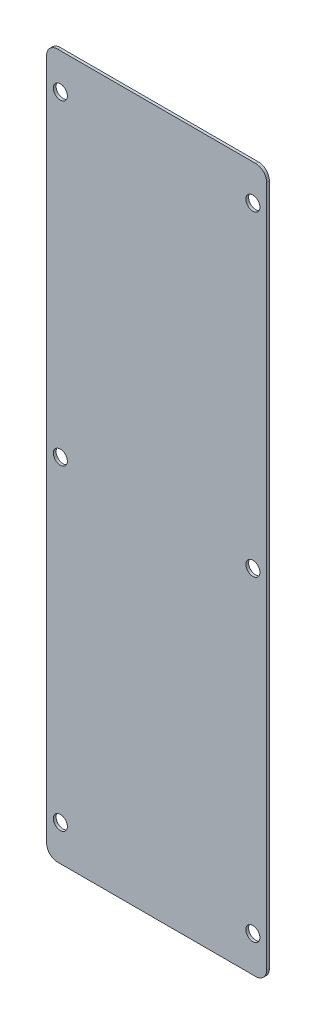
ISO-10303-21;
HEADER;
FILE_DESCRIPTION(('STEP AP214'),'2;1');
FILE_NAME('part.step','',(''),(''),'','','');
FILE_SCHEMA(('AUTOMOTIVE_DESIGN { 1 0 10303 214 1 1 1 1 }'));
ENDSEC;
DATA;
#1=APPLICATION_CONTEXT('core data for automotive mechanical design processes');
#2=APPLICATION_PROTOCOL_DEFINITION('international standard','automotive_design',2000,#1);
#3=PRODUCT_CONTEXT('',#1,'mechanical');
#4=PRODUCT('Part','Part','',(#3));
#5=PRODUCT_RELATED_PRODUCT_CATEGORY('part','',(#4));
#6=PRODUCT_DEFINITION_FORMATION('','',#4);
#7=PRODUCT_DEFINITION_CONTEXT('part definition',#1,'design');
#8=PRODUCT_DEFINITION('design','',#6,#7);
#9=PRODUCT_DEFINITION_SHAPE('','',#8);
#10=(LENGTH_UNIT() NAMED_UNIT(*) SI_UNIT(.MILLI.,.METRE.));
#11=(NAMED_UNIT(*) PLANE_ANGLE_UNIT() SI_UNIT($,.RADIAN.));
#12=(NAMED_UNIT(*) SI_UNIT($,.STERADIAN.) SOLID_ANGLE_UNIT());
#13=UNCERTAINTY_MEASURE_WITH_UNIT(LENGTH_MEASURE(1.E-05),#10,'distance_accuracy_value','');
#14=(GEOMETRIC_REPRESENTATION_CONTEXT(3) GLOBAL_UNCERTAINTY_ASSIGNED_CONTEXT((#13)) GLOBAL_UNIT_ASSIGNED_CONTEXT((#10,
#11,#12)) REPRESENTATION_CONTEXT('',''));
#15=CARTESIAN_POINT('',(0.,0.,0.));
#16=DIRECTION('',(0.,0.,1.));
#17=DIRECTION('',(1.,0.,0.));
#18=AXIS2_PLACEMENT_3D('',#15,#16,#17);
#19=CARTESIAN_POINT('',(40.,-128.,1.));
#20=DIRECTION('',(-1.,0.,0.));
#21=DIRECTION('',(0.,0.,1.));
#22=AXIS2_PLACEMENT_3D('',#19,#20,#21);
#23=PLANE('',#22);
#24=DIRECTION('',(0.,1.,0.));
#25=VECTOR('',#24,1.);
#26=CARTESIAN_POINT('',(40.,-128.,1.));
#27=LINE('',#26,#25);
#28=CARTESIAN_POINT('',(40.,-124.,1.));
#29=VERTEX_POINT('',#28);
#30=CARTESIAN_POINT('',(40.,124.,1.));
#31=VERTEX_POINT('',#30);
#32=EDGE_CURVE('E127',#29,#31,#27,.T.);
#33=ORIENTED_EDGE('',*,*,#32,.F.);
#34=DIRECTION('',(0.,0.,-1.));
#35=VECTOR('',#34,1.);
#36=CARTESIAN_POINT('',(40.,-124.,1.));
#37=LINE('',#36,#35);
#38=CARTESIAN_POINT('',(40.,-124.,0.));
#39=VERTEX_POINT('',#38);
#40=EDGE_CURVE('E11',#29,#39,#37,.T.);
#41=ORIENTED_EDGE('',*,*,#40,.T.);
#42=DIRECTION('',(0.,1.,0.));
#43=VECTOR('',#42,1.);
#44=CARTESIAN_POINT('',(40.,-128.,0.));
#45=LINE('',#44,#43);
#46=CARTESIAN_POINT('',(40.,124.,0.));
#47=VERTEX_POINT('',#46);
#48=EDGE_CURVE('E129',#39,#47,#45,.T.);
#49=ORIENTED_EDGE('',*,*,#48,.T.);
#50=DIRECTION('',(0.,0.,-1.));
#51=VECTOR('',#50,1.);
#52=CARTESIAN_POINT('',(40.,124.,1.));
#53=LINE('',#52,#51);
#54=EDGE_CURVE('E40',#47,#31,#53,.F.);
#55=ORIENTED_EDGE('',*,*,#54,.T.);
#56=EDGE_LOOP('',(#33,#41,#49,#55));
#57=FACE_BOUND('',#56,.T.);
#58=ADVANCED_FACE('F32',(#57),#23,.F.);
#59=CARTESIAN_POINT('',(-40.,128.,1.));
#60=DIRECTION('',(0.,-1.,0.));
#61=DIRECTION('',(0.,0.,-1.));
#62=AXIS2_PLACEMENT_3D('',#59,#60,#61);
#63=PLANE('',#62);
#64=DIRECTION('',(-1.,0.,0.));
#65=VECTOR('',#64,1.);
#66=CARTESIAN_POINT('',(-40.,128.,0.));
#67=LINE('',#66,#65);
#68=CARTESIAN_POINT('',(36.,128.,0.));
#69=VERTEX_POINT('',#68);
#70=CARTESIAN_POINT('',(-36.,128.,0.));
#71=VERTEX_POINT('',#70);
#72=EDGE_CURVE('E125',#69,#71,#67,.T.);
#73=ORIENTED_EDGE('',*,*,#72,.T.);
#74=DIRECTION('',(0.,0.,-1.));
#75=VECTOR('',#74,1.);
#76=CARTESIAN_POINT('',(-36.,128.,1.));
#77=LINE('',#76,#75);
#78=CARTESIAN_POINT('',(-36.,128.,1.));
#79=VERTEX_POINT('',#78);
#80=EDGE_CURVE('E104',#71,#79,#77,.F.);
#81=ORIENTED_EDGE('',*,*,#80,.T.);
#82=DIRECTION('',(-1.,0.,0.));
#83=VECTOR('',#82,1.);
#84=CARTESIAN_POINT('',(-40.,128.,1.));
#85=LINE('',#84,#83);
#86=CARTESIAN_POINT('',(36.,128.,1.));
#87=VERTEX_POINT('',#86);
#88=EDGE_CURVE('E165',#87,#79,#85,.T.);
#89=ORIENTED_EDGE('',*,*,#88,.F.);
#90=DIRECTION('',(0.,0.,-1.));
#91=VECTOR('',#90,1.);
#92=CARTESIAN_POINT('',(36.,128.,1.));
#93=LINE('',#92,#91);
#94=EDGE_CURVE('E109',#87,#69,#93,.T.);
#95=ORIENTED_EDGE('',*,*,#94,.T.);
#96=EDGE_LOOP('',(#73,#81,#89,#95));
#97=FACE_BOUND('',#96,.T.);
#98=ADVANCED_FACE('F169',(#97),#63,.F.);
#99=CARTESIAN_POINT('',(-40.,-128.,1.));
#100=DIRECTION('',(1.,0.,0.));
#101=DIRECTION('',(0.,0.,-1.));
#102=AXIS2_PLACEMENT_3D('',#99,#100,#101);
#103=PLANE('',#102);
#104=DIRECTION('',(0.,-1.,0.));
#105=VECTOR('',#104,1.);
#106=CARTESIAN_POINT('',(-40.,-128.,1.));
#107=LINE('',#106,#105);
#108=CARTESIAN_POINT('',(-40.,124.,1.));
#109=VERTEX_POINT('',#108);
#110=CARTESIAN_POINT('',(-40.,-124.,1.));
#111=VERTEX_POINT('',#110);
#112=EDGE_CURVE('E118',#109,#111,#107,.T.);
#113=ORIENTED_EDGE('',*,*,#112,.F.);
#114=DIRECTION('',(0.,0.,-1.));
#115=VECTOR('',#114,1.);
#116=CARTESIAN_POINT('',(-40.,124.,1.));
#117=LINE('',#116,#115);
#118=CARTESIAN_POINT('',(-40.,124.,0.));
#119=VERTEX_POINT('',#118);
#120=EDGE_CURVE('E103',#109,#119,#117,.T.);
#121=ORIENTED_EDGE('',*,*,#120,.T.);
#122=DIRECTION('',(0.,-1.,0.));
#123=VECTOR('',#122,1.);
#124=CARTESIAN_POINT('',(-40.,-128.,0.));
#125=LINE('',#124,#123);
#126=CARTESIAN_POINT('',(-40.,-124.,0.));
#127=VERTEX_POINT('',#126);
#128=EDGE_CURVE('E116',#119,#127,#125,.T.);
#129=ORIENTED_EDGE('',*,*,#128,.T.);
#130=DIRECTION('',(0.,0.,-1.));
#131=VECTOR('',#130,1.);
#132=CARTESIAN_POINT('',(-40.,-124.,1.));
#133=LINE('',#132,#131);
#134=EDGE_CURVE('E120',#127,#111,#133,.F.);
#135=ORIENTED_EDGE('',*,*,#134,.T.);
#136=EDGE_LOOP('',(#113,#121,#129,#135));
#137=FACE_BOUND('',#136,.T.);
#138=ADVANCED_FACE('F115',(#137),#103,.F.);
#139=CARTESIAN_POINT('',(-40.,-128.,1.));
#140=DIRECTION('',(0.,1.,0.));
#141=DIRECTION('',(0.,0.,1.));
#142=AXIS2_PLACEMENT_3D('',#139,#140,#141);
#143=PLANE('',#142);
#144=DIRECTION('',(1.,0.,0.));
#145=VECTOR('',#144,1.);
#146=CARTESIAN_POINT('',(-40.,-128.,1.));
#147=LINE('',#146,#145);
#148=CARTESIAN_POINT('',(-36.,-128.,1.));
#149=VERTEX_POINT('',#148);
#150=CARTESIAN_POINT('',(36.,-128.,1.));
#151=VERTEX_POINT('',#150);
#152=EDGE_CURVE('E133',#149,#151,#147,.T.);
#153=ORIENTED_EDGE('',*,*,#152,.F.);
#154=DIRECTION('',(0.,0.,-1.));
#155=VECTOR('',#154,1.);
#156=CARTESIAN_POINT('',(-36.,-128.,1.));
#157=LINE('',#156,#155);
#158=CARTESIAN_POINT('',(-36.,-128.,0.));
#159=VERTEX_POINT('',#158);
#160=EDGE_CURVE('E150',#149,#159,#157,.T.);
#161=ORIENTED_EDGE('',*,*,#160,.T.);
#162=DIRECTION('',(1.,0.,0.));
#163=VECTOR('',#162,1.);
#164=CARTESIAN_POINT('',(-40.,-128.,0.));
#165=LINE('',#164,#163);
#166=CARTESIAN_POINT('',(36.,-128.,0.));
#167=VERTEX_POINT('',#166);
#168=EDGE_CURVE('E124',#159,#167,#165,.T.);
#169=ORIENTED_EDGE('',*,*,#168,.T.);
#170=DIRECTION('',(0.,0.,-1.));
#171=VECTOR('',#170,1.);
#172=CARTESIAN_POINT('',(36.,-128.,1.));
#173=LINE('',#172,#171);
#174=EDGE_CURVE('E47',#167,#151,#173,.F.);
#175=ORIENTED_EDGE('',*,*,#174,.T.);
#176=EDGE_LOOP('',(#153,#161,#169,#175));
#177=FACE_BOUND('',#176,.T.);
#178=ADVANCED_FACE('F223',(#177),#143,.F.);
#179=CARTESIAN_POINT('',(0.,0.,1.));
#180=DIRECTION('',(0.,0.,-1.));
#181=DIRECTION('',(-1.,0.,0.));
#182=AXIS2_PLACEMENT_3D('',#179,#180,#181);
#183=PLANE('',#182);
#184=CARTESIAN_POINT('',(-35.0000000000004,-115.,1.));
#185=DIRECTION('',(0.,0.,1.));
#186=DIRECTION('',(1.,0.,0.));
#187=AXIS2_PLACEMENT_3D('',#184,#185,#186);
#188=CIRCLE('',#187,2.55);
#189=CARTESIAN_POINT('',(-32.4500000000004,-115.,1.));
#190=VERTEX_POINT('',#189);
#191=EDGE_CURVE('E200',#190,#190,#188,.T.);
#192=ORIENTED_EDGE('',*,*,#191,.F.);
#193=EDGE_LOOP('',(#192));
#194=FACE_BOUND('',#193,.T.);
#195=CARTESIAN_POINT('',(-35.,1.36830597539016E-13,1.));
#196=DIRECTION('',(0.,0.,1.));
#197=DIRECTION('',(1.,0.,0.));
#198=AXIS2_PLACEMENT_3D('',#195,#196,#197);
#199=CIRCLE('',#198,2.55);
#200=CARTESIAN_POINT('',(-32.45,1.36830597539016E-13,1.));
#201=VERTEX_POINT('',#200);
#202=EDGE_CURVE('E194',#201,#201,#199,.T.);
#203=ORIENTED_EDGE('',*,*,#202,.F.);
#204=EDGE_LOOP('',(#203));
#205=FACE_BOUND('',#204,.T.);
#206=CARTESIAN_POINT('',(35.,-1.16084391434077E-13,1.));
#207=DIRECTION('',(0.,0.,1.));
#208=DIRECTION('',(1.,0.,0.));
#209=AXIS2_PLACEMENT_3D('',#206,#207,#208);
#210=CIRCLE('',#209,2.55);
#211=CARTESIAN_POINT('',(37.55,-1.16084391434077E-13,1.));
#212=VERTEX_POINT('',#211);
#213=EDGE_CURVE('E188',#212,#212,#210,.T.);
#214=ORIENTED_EDGE('',*,*,#213,.F.);
#215=EDGE_LOOP('',(#214));
#216=FACE_BOUND('',#215,.T.);
#217=CARTESIAN_POINT('',(35.0000000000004,115.,1.));
#218=DIRECTION('',(0.,0.,1.));
#219=DIRECTION('',(1.,0.,0.));
#220=AXIS2_PLACEMENT_3D('',#217,#218,#219);
#221=CIRCLE('',#220,2.55);
#222=CARTESIAN_POINT('',(37.5500000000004,115.,1.));
#223=VERTEX_POINT('',#222);
#224=EDGE_CURVE('E181',#223,#223,#221,.T.);
#225=ORIENTED_EDGE('',*,*,#224,.F.);
#226=EDGE_LOOP('',(#225));
#227=FACE_BOUND('',#226,.T.);
#228=CARTESIAN_POINT('',(-34.9999999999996,115.,1.));
#229=DIRECTION('',(0.,0.,1.));
#230=DIRECTION('',(1.,0.,0.));
#231=AXIS2_PLACEMENT_3D('',#228,#229,#230);
#232=CIRCLE('',#231,2.55);
#233=CARTESIAN_POINT('',(-32.4499999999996,115.,1.));
#234=VERTEX_POINT('',#233);
#235=EDGE_CURVE('E205',#234,#234,#232,.T.);
#236=ORIENTED_EDGE('',*,*,#235,.F.);
#237=EDGE_LOOP('',(#236));
#238=FACE_BOUND('',#237,.T.);
#239=CARTESIAN_POINT('',(34.9999999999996,-115.,1.));
#240=DIRECTION('',(0.,0.,1.));
#241=DIRECTION('',(1.,0.,0.));
#242=AXIS2_PLACEMENT_3D('',#239,#240,#241);
#243=CIRCLE('',#242,2.55);
#244=CARTESIAN_POINT('',(37.5499999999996,-115.,1.));
#245=VERTEX_POINT('',#244);
#246=EDGE_CURVE('E172',#245,#245,#243,.T.);
#247=ORIENTED_EDGE('',*,*,#246,.F.);
#248=EDGE_LOOP('',(#247));
#249=FACE_BOUND('',#248,.T.);
#250=ORIENTED_EDGE('',*,*,#88,.T.);
#251=CARTESIAN_POINT('',(-36.,124.,1.));
#252=DIRECTION('',(0.,0.,-1.));
#253=DIRECTION('',(-1.,0.,0.));
#254=AXIS2_PLACEMENT_3D('',#251,#252,#253);
#255=CIRCLE('',#254,4.);
#256=EDGE_CURVE('E147',#79,#109,#255,.F.);
#257=ORIENTED_EDGE('',*,*,#256,.T.);
#258=ORIENTED_EDGE('',*,*,#112,.T.);
#259=CARTESIAN_POINT('',(-36.,-124.,1.));
#260=DIRECTION('',(0.,0.,-1.));
#261=DIRECTION('',(-1.,0.,0.));
#262=AXIS2_PLACEMENT_3D('',#259,#260,#261);
#263=CIRCLE('',#262,4.);
#264=EDGE_CURVE('E54',#111,#149,#263,.F.);
#265=ORIENTED_EDGE('',*,*,#264,.T.);
#266=ORIENTED_EDGE('',*,*,#152,.T.);
#267=CARTESIAN_POINT('',(36.,-124.,1.));
#268=DIRECTION('',(0.,0.,-1.));
#269=DIRECTION('',(-1.,0.,0.));
#270=AXIS2_PLACEMENT_3D('',#267,#268,#269);
#271=CIRCLE('',#270,4.);
#272=EDGE_CURVE('E144',#151,#29,#271,.F.);
#273=ORIENTED_EDGE('',*,*,#272,.T.);
#274=ORIENTED_EDGE('',*,*,#32,.T.);
#275=CARTESIAN_POINT('',(36.,124.,1.));
#276=DIRECTION('',(0.,0.,-1.));
#277=DIRECTION('',(-1.,0.,0.));
#278=AXIS2_PLACEMENT_3D('',#275,#276,#277);
#279=CIRCLE('',#278,4.);
#280=EDGE_CURVE('E142',#31,#87,#279,.F.);
#281=ORIENTED_EDGE('',*,*,#280,.T.);
#282=EDGE_LOOP('',(#250,#257,#258,#265,#266,#273,#274,#281));
#283=FACE_BOUND('',#282,.T.);
#284=ADVANCED_FACE('F162',(#194,#205,#216,#227,#238,#249,#283),#183,.F.);
#285=CARTESIAN_POINT('',(0.,0.,0.));
#286=DIRECTION('',(0.,0.,-1.));
#287=DIRECTION('',(-1.,0.,0.));
#288=AXIS2_PLACEMENT_3D('',#285,#286,#287);
#289=PLANE('',#288);
#290=CARTESIAN_POINT('',(-35.0000000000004,-115.,0.));
#291=DIRECTION('',(0.,0.,1.));
#292=DIRECTION('',(1.,0.,0.));
#293=AXIS2_PLACEMENT_3D('',#290,#291,#292);
#294=CIRCLE('',#293,2.55);
#295=CARTESIAN_POINT('',(-32.4500000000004,-115.,0.));
#296=VERTEX_POINT('',#295);
#297=EDGE_CURVE('E179',#296,#296,#294,.T.);
#298=ORIENTED_EDGE('',*,*,#297,.T.);
#299=EDGE_LOOP('',(#298));
#300=FACE_BOUND('',#299,.T.);
#301=CARTESIAN_POINT('',(-35.,1.36830597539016E-13,0.));
#302=DIRECTION('',(0.,0.,1.));
#303=DIRECTION('',(1.,0.,0.));
#304=AXIS2_PLACEMENT_3D('',#301,#302,#303);
#305=CIRCLE('',#304,2.55);
#306=CARTESIAN_POINT('',(-32.45,1.36830597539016E-13,0.));
#307=VERTEX_POINT('',#306);
#308=EDGE_CURVE('E197',#307,#307,#305,.T.);
#309=ORIENTED_EDGE('',*,*,#308,.T.);
#310=EDGE_LOOP('',(#309));
#311=FACE_BOUND('',#310,.T.);
#312=CARTESIAN_POINT('',(35.,-1.16084391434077E-13,0.));
#313=DIRECTION('',(0.,0.,1.));
#314=DIRECTION('',(1.,0.,0.));
#315=AXIS2_PLACEMENT_3D('',#312,#313,#314);
#316=CIRCLE('',#315,2.55);
#317=CARTESIAN_POINT('',(37.55,-1.16084391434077E-13,0.));
#318=VERTEX_POINT('',#317);
#319=EDGE_CURVE('E191',#318,#318,#316,.T.);
#320=ORIENTED_EDGE('',*,*,#319,.T.);
#321=EDGE_LOOP('',(#320));
#322=FACE_BOUND('',#321,.T.);
#323=CARTESIAN_POINT('',(35.0000000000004,115.,0.));
#324=DIRECTION('',(0.,0.,1.));
#325=DIRECTION('',(1.,0.,0.));
#326=AXIS2_PLACEMENT_3D('',#323,#324,#325);
#327=CIRCLE('',#326,2.55);
#328=CARTESIAN_POINT('',(37.5500000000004,115.,0.));
#329=VERTEX_POINT('',#328);
#330=EDGE_CURVE('E184',#329,#329,#327,.T.);
#331=ORIENTED_EDGE('',*,*,#330,.T.);
#332=EDGE_LOOP('',(#331));
#333=FACE_BOUND('',#332,.T.);
#334=CARTESIAN_POINT('',(-34.9999999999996,115.,0.));
#335=DIRECTION('',(0.,0.,1.));
#336=DIRECTION('',(1.,0.,0.));
#337=AXIS2_PLACEMENT_3D('',#334,#335,#336);
#338=CIRCLE('',#337,2.55);
#339=CARTESIAN_POINT('',(-32.4499999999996,115.,0.));
#340=VERTEX_POINT('',#339);
#341=EDGE_CURVE('E185',#340,#340,#338,.T.);
#342=ORIENTED_EDGE('',*,*,#341,.T.);
#343=EDGE_LOOP('',(#342));
#344=FACE_BOUND('',#343,.T.);
#345=CARTESIAN_POINT('',(34.9999999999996,-115.,0.));
#346=DIRECTION('',(0.,0.,1.));
#347=DIRECTION('',(1.,0.,0.));
#348=AXIS2_PLACEMENT_3D('',#345,#346,#347);
#349=CIRCLE('',#348,2.55);
#350=CARTESIAN_POINT('',(37.5499999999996,-115.,0.));
#351=VERTEX_POINT('',#350);
#352=EDGE_CURVE('E170',#351,#351,#349,.T.);
#353=ORIENTED_EDGE('',*,*,#352,.T.);
#354=EDGE_LOOP('',(#353));
#355=FACE_BOUND('',#354,.T.);
#356=ORIENTED_EDGE('',*,*,#128,.F.);
#357=CARTESIAN_POINT('',(-36.,124.,0.));
#358=DIRECTION('',(0.,0.,-1.));
#359=DIRECTION('',(-1.,0.,0.));
#360=AXIS2_PLACEMENT_3D('',#357,#358,#359);
#361=CIRCLE('',#360,4.);
#362=EDGE_CURVE('E99',#119,#71,#361,.T.);
#363=ORIENTED_EDGE('',*,*,#362,.T.);
#364=ORIENTED_EDGE('',*,*,#72,.F.);
#365=CARTESIAN_POINT('',(36.,124.,0.));
#366=DIRECTION('',(0.,0.,-1.));
#367=DIRECTION('',(-1.,0.,0.));
#368=AXIS2_PLACEMENT_3D('',#365,#366,#367);
#369=CIRCLE('',#368,4.);
#370=EDGE_CURVE('E119',#69,#47,#369,.T.);
#371=ORIENTED_EDGE('',*,*,#370,.T.);
#372=ORIENTED_EDGE('',*,*,#48,.F.);
#373=CARTESIAN_POINT('',(36.,-124.,0.));
#374=DIRECTION('',(0.,0.,-1.));
#375=DIRECTION('',(-1.,0.,0.));
#376=AXIS2_PLACEMENT_3D('',#373,#374,#375);
#377=CIRCLE('',#376,4.);
#378=EDGE_CURVE('E136',#39,#167,#377,.T.);
#379=ORIENTED_EDGE('',*,*,#378,.T.);
#380=ORIENTED_EDGE('',*,*,#168,.F.);
#381=CARTESIAN_POINT('',(-36.,-124.,0.));
#382=DIRECTION('',(0.,0.,-1.));
#383=DIRECTION('',(-1.,0.,0.));
#384=AXIS2_PLACEMENT_3D('',#381,#382,#383);
#385=CIRCLE('',#384,4.);
#386=EDGE_CURVE('E110',#159,#127,#385,.T.);
#387=ORIENTED_EDGE('',*,*,#386,.T.);
#388=EDGE_LOOP('',(#356,#363,#364,#371,#372,#379,#380,#387));
#389=FACE_BOUND('',#388,.T.);
#390=ADVANCED_FACE('F122',(#300,#311,#322,#333,#344,#355,#389),#289,.T.);
#391=CARTESIAN_POINT('',(-36.,124.,1.));
#392=DIRECTION('',(0.,0.,-1.));
#393=DIRECTION('',(-1.,0.,0.));
#394=AXIS2_PLACEMENT_3D('',#391,#392,#393);
#395=CYLINDRICAL_SURFACE('',#394,4.);
#396=ORIENTED_EDGE('',*,*,#256,.F.);
#397=ORIENTED_EDGE('',*,*,#80,.F.);
#398=ORIENTED_EDGE('',*,*,#362,.F.);
#399=ORIENTED_EDGE('',*,*,#120,.F.);
#400=EDGE_LOOP('',(#396,#397,#398,#399));
#401=FACE_BOUND('',#400,.T.);
#402=ADVANCED_FACE('F102',(#401),#395,.T.);
#403=CARTESIAN_POINT('',(-36.,-124.,1.));
#404=DIRECTION('',(0.,0.,-1.));
#405=DIRECTION('',(-1.,0.,0.));
#406=AXIS2_PLACEMENT_3D('',#403,#404,#405);
#407=CYLINDRICAL_SURFACE('',#406,4.);
#408=ORIENTED_EDGE('',*,*,#264,.F.);
#409=ORIENTED_EDGE('',*,*,#134,.F.);
#410=ORIENTED_EDGE('',*,*,#386,.F.);
#411=ORIENTED_EDGE('',*,*,#160,.F.);
#412=EDGE_LOOP('',(#408,#409,#410,#411));
#413=FACE_BOUND('',#412,.T.);
#414=ADVANCED_FACE('F247',(#413),#407,.T.);
#415=CARTESIAN_POINT('',(36.,-124.,1.));
#416=DIRECTION('',(0.,0.,-1.));
#417=DIRECTION('',(-1.,0.,0.));
#418=AXIS2_PLACEMENT_3D('',#415,#416,#417);
#419=CYLINDRICAL_SURFACE('',#418,4.);
#420=ORIENTED_EDGE('',*,*,#272,.F.);
#421=ORIENTED_EDGE('',*,*,#174,.F.);
#422=ORIENTED_EDGE('',*,*,#378,.F.);
#423=ORIENTED_EDGE('',*,*,#40,.F.);
#424=EDGE_LOOP('',(#420,#421,#422,#423));
#425=FACE_BOUND('',#424,.T.);
#426=ADVANCED_FACE('F234',(#425),#419,.T.);
#427=CARTESIAN_POINT('',(36.,124.,1.));
#428=DIRECTION('',(0.,0.,-1.));
#429=DIRECTION('',(-1.,0.,0.));
#430=AXIS2_PLACEMENT_3D('',#427,#428,#429);
#431=CYLINDRICAL_SURFACE('',#430,4.);
#432=ORIENTED_EDGE('',*,*,#280,.F.);
#433=ORIENTED_EDGE('',*,*,#54,.F.);
#434=ORIENTED_EDGE('',*,*,#370,.F.);
#435=ORIENTED_EDGE('',*,*,#94,.F.);
#436=EDGE_LOOP('',(#432,#433,#434,#435));
#437=FACE_BOUND('',#436,.T.);
#438=ADVANCED_FACE('F34',(#437),#431,.T.);
#439=CARTESIAN_POINT('',(34.9999999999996,-115.,0.));
#440=DIRECTION('',(0.,0.,1.));
#441=DIRECTION('',(1.,0.,0.));
#442=AXIS2_PLACEMENT_3D('',#439,#440,#441);
#443=CYLINDRICAL_SURFACE('',#442,2.55);
#444=ORIENTED_EDGE('',*,*,#352,.F.);
#445=EDGE_LOOP('',(#444));
#446=FACE_BOUND('',#445,.T.);
#447=ORIENTED_EDGE('',*,*,#246,.T.);
#448=EDGE_LOOP('',(#447));
#449=FACE_BOUND('',#448,.T.);
#450=ADVANCED_FACE('F217',(#446,#449),#443,.F.);
#451=CARTESIAN_POINT('',(-34.9999999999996,115.,0.));
#452=DIRECTION('',(0.,0.,1.));
#453=DIRECTION('',(1.,0.,0.));
#454=AXIS2_PLACEMENT_3D('',#451,#452,#453);
#455=CYLINDRICAL_SURFACE('',#454,2.55);
#456=ORIENTED_EDGE('',*,*,#341,.F.);
#457=EDGE_LOOP('',(#456));
#458=FACE_BOUND('',#457,.T.);
#459=ORIENTED_EDGE('',*,*,#235,.T.);
#460=EDGE_LOOP('',(#459));
#461=FACE_BOUND('',#460,.T.);
#462=ADVANCED_FACE('F213',(#458,#461),#455,.F.);
#463=CARTESIAN_POINT('',(35.0000000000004,115.,0.));
#464=DIRECTION('',(0.,0.,1.));
#465=DIRECTION('',(1.,0.,0.));
#466=AXIS2_PLACEMENT_3D('',#463,#464,#465);
#467=CYLINDRICAL_SURFACE('',#466,2.55);
#468=ORIENTED_EDGE('',*,*,#330,.F.);
#469=EDGE_LOOP('',(#468));
#470=FACE_BOUND('',#469,.T.);
#471=ORIENTED_EDGE('',*,*,#224,.T.);
#472=EDGE_LOOP('',(#471));
#473=FACE_BOUND('',#472,.T.);
#474=ADVANCED_FACE('F216',(#470,#473),#467,.F.);
#475=CARTESIAN_POINT('',(35.,-1.16084391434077E-13,0.));
#476=DIRECTION('',(0.,0.,1.));
#477=DIRECTION('',(1.,0.,0.));
#478=AXIS2_PLACEMENT_3D('',#475,#476,#477);
#479=CYLINDRICAL_SURFACE('',#478,2.55);
#480=ORIENTED_EDGE('',*,*,#319,.F.);
#481=EDGE_LOOP('',(#480));
#482=FACE_BOUND('',#481,.T.);
#483=ORIENTED_EDGE('',*,*,#213,.T.);
#484=EDGE_LOOP('',(#483));
#485=FACE_BOUND('',#484,.T.);
#486=ADVANCED_FACE('F297',(#482,#485),#479,.F.);
#487=CARTESIAN_POINT('',(-35.,1.36830597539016E-13,0.));
#488=DIRECTION('',(0.,0.,1.));
#489=DIRECTION('',(1.,0.,0.));
#490=AXIS2_PLACEMENT_3D('',#487,#488,#489);
#491=CYLINDRICAL_SURFACE('',#490,2.55);
#492=ORIENTED_EDGE('',*,*,#308,.F.);
#493=EDGE_LOOP('',(#492));
#494=FACE_BOUND('',#493,.T.);
#495=ORIENTED_EDGE('',*,*,#202,.T.);
#496=EDGE_LOOP('',(#495));
#497=FACE_BOUND('',#496,.T.);
#498=ADVANCED_FACE('F306',(#494,#497),#491,.F.);
#499=CARTESIAN_POINT('',(-35.0000000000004,-115.,0.));
#500=DIRECTION('',(0.,0.,1.));
#501=DIRECTION('',(1.,0.,0.));
#502=AXIS2_PLACEMENT_3D('',#499,#500,#501);
#503=CYLINDRICAL_SURFACE('',#502,2.55);
#504=ORIENTED_EDGE('',*,*,#297,.F.);
#505=EDGE_LOOP('',(#504));
#506=FACE_BOUND('',#505,.T.);
#507=ORIENTED_EDGE('',*,*,#191,.T.);
#508=EDGE_LOOP('',(#507));
#509=FACE_BOUND('',#508,.T.);
#510=ADVANCED_FACE('F316',(#506,#509),#503,.F.);
#511=CLOSED_SHELL('',(#58,#98,#138,#178,#284,#390,#402,#414,#426,#438,#450,#462,#474,#486,#498,#510));
#512=MANIFOLD_SOLID_BREP('B2',#511);
#513=ADVANCED_BREP_SHAPE_REPRESENTATION('',(#18,#512),#14);
#514=SHAPE_DEFINITION_REPRESENTATION(#9,#513);
ENDSEC;
END-ISO-10303-21;
